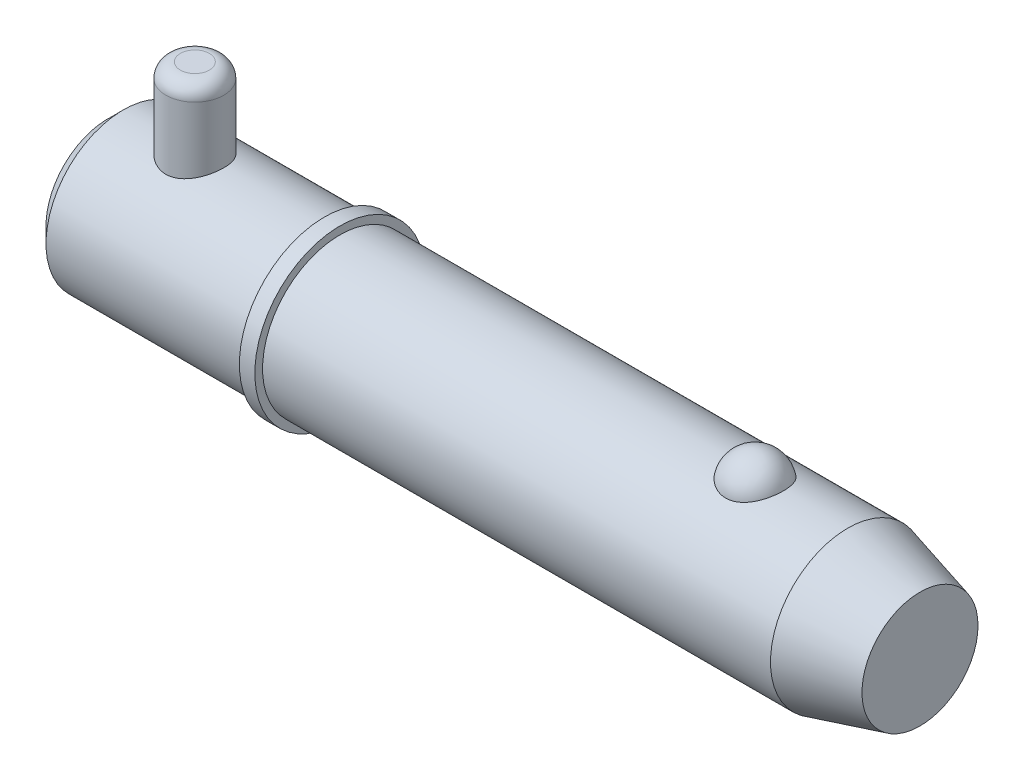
ISO-10303-21;
HEADER;
FILE_DESCRIPTION(('STEP AP214'),'2;1');
FILE_NAME('part.step','',(''),(''),'','','');
FILE_SCHEMA(('AUTOMOTIVE_DESIGN { 1 0 10303 214 1 1 1 1 }'));
ENDSEC;
DATA;
#1=APPLICATION_CONTEXT('core data for automotive mechanical design processes');
#2=APPLICATION_PROTOCOL_DEFINITION('international standard','automotive_design',2000,#1);
#3=PRODUCT_CONTEXT('',#1,'mechanical');
#4=PRODUCT('Part','Part','',(#3));
#5=PRODUCT_RELATED_PRODUCT_CATEGORY('part','',(#4));
#6=PRODUCT_DEFINITION_FORMATION('','',#4);
#7=PRODUCT_DEFINITION_CONTEXT('part definition',#1,'design');
#8=PRODUCT_DEFINITION('design','',#6,#7);
#9=PRODUCT_DEFINITION_SHAPE('','',#8);
#10=(LENGTH_UNIT() NAMED_UNIT(*) SI_UNIT(.MILLI.,.METRE.));
#11=(NAMED_UNIT(*) PLANE_ANGLE_UNIT() SI_UNIT($,.RADIAN.));
#12=(NAMED_UNIT(*) SI_UNIT($,.STERADIAN.) SOLID_ANGLE_UNIT());
#13=UNCERTAINTY_MEASURE_WITH_UNIT(LENGTH_MEASURE(1.E-05),#10,'distance_accuracy_value','');
#14=(GEOMETRIC_REPRESENTATION_CONTEXT(3) GLOBAL_UNCERTAINTY_ASSIGNED_CONTEXT((#13)) GLOBAL_UNIT_ASSIGNED_CONTEXT((#10,
#11,#12)) REPRESENTATION_CONTEXT('',''));
#15=CARTESIAN_POINT('',(0.,0.,0.));
#16=DIRECTION('',(0.,0.,1.));
#17=DIRECTION('',(1.,0.,0.));
#18=AXIS2_PLACEMENT_3D('',#15,#16,#17);
#19=CARTESIAN_POINT('',(14.28,25.4,0.));
#20=DIRECTION('',(0.,-1.,0.));
#21=DIRECTION('',(0.,0.,-1.));
#22=AXIS2_PLACEMENT_3D('',#19,#20,#21);
#23=CYLINDRICAL_SURFACE('',#22,4.76);
#24=CARTESIAN_POINT('',(14.28,-10.32,0.));
#25=DIRECTION('',(0.,1.,0.));
#26=DIRECTION('',(0.,0.,1.));
#27=AXIS2_PLACEMENT_3D('',#24,#25,#26);
#28=CIRCLE('',#27,4.76);
#29=CARTESIAN_POINT('',(14.28,-10.32,-4.76));
#30=VERTEX_POINT('',#29);
#31=EDGE_CURVE('P0_E25',#30,#30,#28,.T.);
#32=CARTESIAN_POINT('',(14.28,23.02,0.));
#33=DIRECTION('',(0.,1.,0.));
#34=DIRECTION('',(0.,0.,1.));
#35=AXIS2_PLACEMENT_3D('',#32,#33,#34);
#36=CIRCLE('',#35,4.76);
#37=CARTESIAN_POINT('',(14.28,23.02,-4.76));
#38=VERTEX_POINT('',#37);
#39=EDGE_CURVE('P0_E29',#38,#38,#36,.F.);
#40=CARTESIAN_POINT('',(14.28,-10.32,-4.76));
#41=CARTESIAN_POINT('',(14.28,-9.97270833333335,-4.76));
#42=CARTESIAN_POINT('',(14.28,-9.62541666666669,-4.76));
#43=CARTESIAN_POINT('',(14.28,-8.93083333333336,-4.76));
#44=CARTESIAN_POINT('',(14.28,-8.58354166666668,-4.76));
#45=CARTESIAN_POINT('',(14.28,-7.88895833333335,-4.76));
#46=CARTESIAN_POINT('',(14.28,-7.54166666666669,-4.76));
#47=CARTESIAN_POINT('',(14.28,-6.84708333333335,-4.76));
#48=CARTESIAN_POINT('',(14.28,-6.49979166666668,-4.76));
#49=CARTESIAN_POINT('',(14.28,-5.80520833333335,-4.76));
#50=CARTESIAN_POINT('',(14.28,-5.45791666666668,-4.76));
#51=CARTESIAN_POINT('',(14.28,-4.76333333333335,-4.76));
#52=CARTESIAN_POINT('',(14.28,-4.41604166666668,-4.76));
#53=CARTESIAN_POINT('',(14.28,-3.72145833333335,-4.76));
#54=CARTESIAN_POINT('',(14.28,-3.37416666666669,-4.76));
#55=CARTESIAN_POINT('',(14.28,-2.67958333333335,-4.76));
#56=CARTESIAN_POINT('',(14.28,-2.33229166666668,-4.76));
#57=CARTESIAN_POINT('',(14.28,-1.63770833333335,-4.76));
#58=CARTESIAN_POINT('',(14.28,-1.29041666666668,-4.76));
#59=CARTESIAN_POINT('',(14.28,-0.595833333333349,-4.76));
#60=CARTESIAN_POINT('',(14.28,-0.24854166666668,-4.76));
#61=CARTESIAN_POINT('',(14.28,0.446041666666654,-4.76));
#62=CARTESIAN_POINT('',(14.28,0.793333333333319,-4.76));
#63=CARTESIAN_POINT('',(14.28,1.48791666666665,-4.76));
#64=CARTESIAN_POINT('',(14.28,1.83520833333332,-4.76));
#65=CARTESIAN_POINT('',(14.28,2.52979166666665,-4.76));
#66=CARTESIAN_POINT('',(14.28,2.87708333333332,-4.76));
#67=CARTESIAN_POINT('',(14.28,3.57166666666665,-4.76));
#68=CARTESIAN_POINT('',(14.28,3.91895833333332,-4.76));
#69=CARTESIAN_POINT('',(14.28,4.61354166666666,-4.76));
#70=CARTESIAN_POINT('',(14.28,4.96083333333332,-4.76));
#71=CARTESIAN_POINT('',(14.28,5.65541666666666,-4.76));
#72=CARTESIAN_POINT('',(14.28,6.00270833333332,-4.76));
#73=CARTESIAN_POINT('',(14.28,6.69729166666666,-4.76));
#74=CARTESIAN_POINT('',(14.28,7.04458333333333,-4.76));
#75=CARTESIAN_POINT('',(14.28,7.73916666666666,-4.76));
#76=CARTESIAN_POINT('',(14.28,8.08645833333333,-4.76));
#77=CARTESIAN_POINT('',(14.28,8.78104166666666,-4.76));
#78=CARTESIAN_POINT('',(14.28,9.12833333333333,-4.76));
#79=CARTESIAN_POINT('',(14.28,9.82291666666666,-4.76));
#80=CARTESIAN_POINT('',(14.28,10.1702083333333,-4.76));
#81=CARTESIAN_POINT('',(14.28,10.8647916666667,-4.76));
#82=CARTESIAN_POINT('',(14.28,11.2120833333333,-4.76));
#83=CARTESIAN_POINT('',(14.28,11.9066666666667,-4.76));
#84=CARTESIAN_POINT('',(14.28,12.2539583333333,-4.76));
#85=CARTESIAN_POINT('',(14.28,12.9485416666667,-4.76));
#86=CARTESIAN_POINT('',(14.28,13.2958333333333,-4.76));
#87=CARTESIAN_POINT('',(14.28,13.9904166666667,-4.76));
#88=CARTESIAN_POINT('',(14.28,14.3377083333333,-4.76));
#89=CARTESIAN_POINT('',(14.28,15.0322916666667,-4.76));
#90=CARTESIAN_POINT('',(14.28,15.3795833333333,-4.76));
#91=CARTESIAN_POINT('',(14.28,16.0741666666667,-4.76));
#92=CARTESIAN_POINT('',(14.28,16.4214583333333,-4.76));
#93=CARTESIAN_POINT('',(14.28,17.1160416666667,-4.76));
#94=CARTESIAN_POINT('',(14.28,17.4633333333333,-4.76));
#95=CARTESIAN_POINT('',(14.28,18.1579166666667,-4.76));
#96=CARTESIAN_POINT('',(14.28,18.5052083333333,-4.76));
#97=CARTESIAN_POINT('',(14.28,19.1997916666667,-4.76));
#98=CARTESIAN_POINT('',(14.28,19.5470833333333,-4.76));
#99=CARTESIAN_POINT('',(14.28,20.2416666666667,-4.76));
#100=CARTESIAN_POINT('',(14.28,20.5889583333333,-4.76));
#101=CARTESIAN_POINT('',(14.28,21.2835416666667,-4.76));
#102=CARTESIAN_POINT('',(14.28,21.6308333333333,-4.76));
#103=CARTESIAN_POINT('',(14.28,22.3254166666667,-4.76));
#104=CARTESIAN_POINT('',(14.28,22.6727083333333,-4.76));
#105=CARTESIAN_POINT('',(14.28,23.02,-4.76));
#106=B_SPLINE_CURVE_WITH_KNOTS('',3,(#40,#41,#42,#43,#44,#45,#46,#47,#48,#49,#50,#51,#52,#53,
#54,#55,#56,#57,#58,#59,#60,#61,#62,#63,#64,#65,#66,#67,#68,#69,#70,#71,#72,#73,#74,#75,#76,#77,
#78,#79,#80,#81,#82,#83,#84,#85,#86,#87,#88,#89,#90,#91,#92,#93,#94,#95,#96,#97,#98,#99,#100,
#101,#102,#103,#104,#105),.UNSPECIFIED.,.F.,.F.,(4,2,2,2,2,2,2,2,2,2,2,2,2,2,2,2,2,2,2,2,2,2,2,
2,2,2,2,2,2,2,2,2,4),(0.,1.041875,2.08375,3.125625,4.1675,5.209375,6.25125,7.293125,
8.33500000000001,9.376875,10.41875,11.460625,12.5025,13.544375,14.58625,15.628125,16.67,
17.711875,18.75375,19.795625,20.8375,21.879375,22.92125,23.963125,25.005,26.046875,27.08875,
28.130625,29.1725,30.214375,31.25625,32.298125,33.34),.UNSPECIFIED.);
#107=EDGE_CURVE('P0_BSEAM14',#30,#38,#106,.T.);
#108=ORIENTED_EDGE('',*,*,#31,.T.);
#109=ORIENTED_EDGE('',*,*,#39,.T.);
#110=ORIENTED_EDGE('',*,*,#107,.T.);
#111=ORIENTED_EDGE('',*,*,#107,.F.);
#112=EDGE_LOOP('',(#108,#110,#109,#111));
#113=FACE_BOUND('',#112,.T.);
#114=ADVANCED_FACE('P0_F14',(#113),#23,.T.);
#115=CARTESIAN_POINT('',(14.28,25.4,0.));
#116=DIRECTION('',(0.,1.,0.));
#117=DIRECTION('',(0.,0.,1.));
#118=AXIS2_PLACEMENT_3D('',#115,#116,#117);
#119=PLANE('',#118);
#120=CARTESIAN_POINT('',(14.28,25.4,0.));
#121=DIRECTION('',(0.,1.,0.));
#122=DIRECTION('',(0.,0.,1.));
#123=AXIS2_PLACEMENT_3D('',#120,#121,#122);
#124=CIRCLE('',#123,2.38);
#125=CARTESIAN_POINT('',(14.28,25.4,2.38));
#126=VERTEX_POINT('',#125);
#127=EDGE_CURVE('P0_E10',#126,#126,#124,.T.);
#128=ORIENTED_EDGE('',*,*,#127,.T.);
#129=EDGE_LOOP('',(#128));
#130=FACE_BOUND('',#129,.T.);
#131=ADVANCED_FACE('P0_F46',(#130),#119,.T.);
#132=CARTESIAN_POINT('',(14.28,-12.7,0.));
#133=DIRECTION('',(0.,1.,0.));
#134=DIRECTION('',(0.,0.,1.));
#135=AXIS2_PLACEMENT_3D('',#132,#133,#134);
#136=PLANE('',#135);
#137=CARTESIAN_POINT('',(14.28,-12.7,0.));
#138=DIRECTION('',(0.,1.,0.));
#139=DIRECTION('',(0.,0.,1.));
#140=AXIS2_PLACEMENT_3D('',#137,#138,#139);
#141=CIRCLE('',#140,2.38);
#142=CARTESIAN_POINT('',(14.28,-12.7,2.38));
#143=VERTEX_POINT('',#142);
#144=EDGE_CURVE('P0_E21',#143,#143,#141,.F.);
#145=ORIENTED_EDGE('',*,*,#144,.T.);
#146=EDGE_LOOP('',(#145));
#147=FACE_BOUND('',#146,.T.);
#148=ADVANCED_FACE('P0_F43',(#147),#136,.F.);
#149=CARTESIAN_POINT('',(14.28,-10.32,0.));
#150=DIRECTION('',(0.,1.,0.));
#151=DIRECTION('',(0.,0.,1.));
#152=AXIS2_PLACEMENT_3D('',#149,#150,#151);
#153=DEGENERATE_TOROIDAL_SURFACE('',#152,2.38,2.38,.T.);
#154=ORIENTED_EDGE('',*,*,#144,.F.);
#155=EDGE_LOOP('',(#154));
#156=FACE_BOUND('',#155,.T.);
#157=ORIENTED_EDGE('',*,*,#31,.F.);
#158=EDGE_LOOP('',(#157));
#159=FACE_BOUND('',#158,.T.);
#160=ADVANCED_FACE('P0_F38',(#156,#159),#153,.T.);
#161=CARTESIAN_POINT('',(14.28,23.02,0.));
#162=DIRECTION('',(0.,1.,0.));
#163=DIRECTION('',(0.,0.,1.));
#164=AXIS2_PLACEMENT_3D('',#161,#162,#163);
#165=DEGENERATE_TOROIDAL_SURFACE('',#164,2.38,2.38,.T.);
#166=ORIENTED_EDGE('',*,*,#39,.F.);
#167=EDGE_LOOP('',(#166));
#168=FACE_BOUND('',#167,.T.);
#169=ORIENTED_EDGE('',*,*,#127,.F.);
#170=EDGE_LOOP('',(#169));
#171=FACE_BOUND('',#170,.T.);
#172=ADVANCED_FACE('P0_F16',(#168,#171),#165,.T.);
#173=CLOSED_SHELL('',(#114,#131,#148,#160,#172));
#174=MANIFOLD_SOLID_BREP('P0_B1',#173);
#175=CARTESIAN_POINT('',(0.,0.,0.));
#176=DIRECTION('',(1.,0.,0.));
#177=DIRECTION('',(0.,0.,-1.));
#178=AXIS2_PLACEMENT_3D('',#175,#176,#177);
#179=CYLINDRICAL_SURFACE('',#178,12.7);
#180=CARTESIAN_POINT('',(121.500738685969,0.,0.));
#181=DIRECTION('',(1.,0.,0.));
#182=DIRECTION('',(0.,0.,-1.));
#183=AXIS2_PLACEMENT_3D('',#180,#181,#182);
#184=CIRCLE('',#183,12.7);
#185=CARTESIAN_POINT('',(121.500738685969,0.,-12.7));
#186=VERTEX_POINT('',#185);
#187=EDGE_CURVE('P1_E81',#186,#186,#184,.T.);
#188=ORIENTED_EDGE('',*,*,#187,.F.);
#189=EDGE_LOOP('',(#188));
#190=FACE_BOUND('',#189,.T.);
#191=CARTESIAN_POINT('',(38.1,0.,0.));
#192=DIRECTION('',(1.,0.,0.));
#193=DIRECTION('',(0.,0.,-1.));
#194=AXIS2_PLACEMENT_3D('',#191,#192,#193);
#195=CIRCLE('',#194,12.7);
#196=CARTESIAN_POINT('',(38.1,0.,-12.7));
#197=VERTEX_POINT('',#196);
#198=EDGE_CURVE('P1_E85',#197,#197,#195,.T.);
#199=ORIENTED_EDGE('',*,*,#198,.T.);
#200=EDGE_LOOP('',(#199));
#201=FACE_BOUND('',#200,.T.);
#202=CARTESIAN_POINT('',(106.260042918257,11.7500437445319,4.81938502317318));
#203=CARTESIAN_POINT('',(106.135088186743,11.7500430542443,4.81938571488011));
#204=CARTESIAN_POINT('',(106.010144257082,11.7520975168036,4.81438658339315));
#205=CARTESIAN_POINT('',(105.761142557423,11.760253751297,4.79442904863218));
#206=CARTESIAN_POINT('',(105.637085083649,11.7663568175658,4.77946746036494));
#207=CARTESIAN_POINT('',(105.390901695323,11.7824262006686,4.7397141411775));
#208=CARTESIAN_POINT('',(105.268774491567,11.7923898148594,4.71492928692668));
#209=CARTESIAN_POINT('',(105.027187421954,11.8158938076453,4.65571340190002));
#210=CARTESIAN_POINT('',(104.90772859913,11.8294355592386,4.6212786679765));
#211=CARTESIAN_POINT('',(104.672557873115,11.8596812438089,4.54309502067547));
#212=CARTESIAN_POINT('',(104.556839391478,11.8763792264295,4.49936361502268));
#213=CARTESIAN_POINT('',(104.329653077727,11.9124878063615,4.40287235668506));
#214=CARTESIAN_POINT('',(104.218186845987,11.9318994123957,4.35010914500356));
#215=CARTESIAN_POINT('',(103.891278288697,11.9934256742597,4.17881316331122));
#216=CARTESIAN_POINT('',(103.683127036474,12.038858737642,4.04720756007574));
#217=CARTESIAN_POINT('',(103.285850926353,12.1352173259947,3.748564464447));
#218=CARTESIAN_POINT('',(103.097443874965,12.1862630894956,3.58061821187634));
#219=CARTESIAN_POINT('',(102.750521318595,12.2875163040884,3.21600758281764));
#220=CARTESIAN_POINT('',(102.592011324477,12.3377235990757,3.0193379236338));
#221=CARTESIAN_POINT('',(102.30168878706,12.434492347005,2.592916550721));
#222=CARTESIAN_POINT('',(102.171376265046,12.4807925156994,2.36208286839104));
#223=CARTESIAN_POINT('',(101.949407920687,12.5623454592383,1.88070399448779));
#224=CARTESIAN_POINT('',(101.857755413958,12.5975972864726,1.63015711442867));
#225=CARTESIAN_POINT('',(101.714046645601,12.6538414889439,1.1129886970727));
#226=CARTESIAN_POINT('',(101.662499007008,12.6746503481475,0.846205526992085));
#227=CARTESIAN_POINT('',(101.601977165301,12.699153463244,0.307085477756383));
#228=CARTESIAN_POINT('',(101.593001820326,12.7028481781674,0.0347487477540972));
#229=CARTESIAN_POINT('',(101.617731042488,12.6927785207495,-0.506073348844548));
#230=CARTESIAN_POINT('',(101.651189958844,12.6791146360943,-0.77457186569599));
#231=CARTESIAN_POINT('',(101.759687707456,12.635882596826,-1.30170246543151));
#232=CARTESIAN_POINT('',(101.83472729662,12.606314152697,-1.5603343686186));
#233=CARTESIAN_POINT('',(102.02500006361,12.5342328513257,-2.06083899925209));
#234=CARTESIAN_POINT('',(102.140287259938,12.4917026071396,-2.3026886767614));
#235=CARTESIAN_POINT('',(102.408704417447,12.3981123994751,-2.76259600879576));
#236=CARTESIAN_POINT('',(102.561837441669,12.3470517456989,-2.98065173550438));
#237=CARTESIAN_POINT('',(102.903507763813,12.2416045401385,-3.38786328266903));
#238=CARTESIAN_POINT('',(103.092201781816,12.1872040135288,-3.57688418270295));
#239=CARTESIAN_POINT('',(103.500239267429,12.0814086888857,-3.91941073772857));
#240=CARTESIAN_POINT('',(103.719580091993,12.0300136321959,-4.07291945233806));
#241=CARTESIAN_POINT('',(104.178375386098,11.9373542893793,-4.33691289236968));
#242=CARTESIAN_POINT('',(104.417304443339,11.8958982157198,-4.44824125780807));
#243=CARTESIAN_POINT('',(104.91243761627,11.8268116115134,-4.62881985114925));
#244=CARTESIAN_POINT('',(105.168635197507,11.7991758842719,-4.69808589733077));
#245=CARTESIAN_POINT('',(105.677164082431,11.7622209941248,-4.78983181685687));
#246=CARTESIAN_POINT('',(105.929041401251,11.7520502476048,-4.81449025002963));
#247=CARTESIAN_POINT('',(106.433573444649,11.7485796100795,-4.82295735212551));
#248=CARTESIAN_POINT('',(106.686228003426,11.7552763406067,-4.80677420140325));
#249=CARTESIAN_POINT('',(107.176834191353,11.7842584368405,-4.73525430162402));
#250=CARTESIAN_POINT('',(107.414998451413,11.8060486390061,-4.68116061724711));
#251=CARTESIAN_POINT('',(107.878489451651,11.8622750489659,-4.53678133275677));
#252=CARTESIAN_POINT('',(108.103815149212,11.8967122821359,-4.44649279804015));
#253=CARTESIAN_POINT('',(108.540801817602,11.9754603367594,-4.2298761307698));
#254=CARTESIAN_POINT('',(108.752057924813,12.0199699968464,-4.10280539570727));
#255=CARTESIAN_POINT('',(109.150601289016,12.1138028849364,-3.81685409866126));
#256=CARTESIAN_POINT('',(109.337883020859,12.163127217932,-3.65796622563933));
#257=CARTESIAN_POINT('',(109.693350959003,12.2642343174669,-3.30364864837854));
#258=CARTESIAN_POINT('',(109.860111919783,12.3160165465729,-3.10678783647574));
#259=CARTESIAN_POINT('',(110.159579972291,12.4142566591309,-2.68748409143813));
#260=CARTESIAN_POINT('',(110.292280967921,12.4607135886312,-2.46503658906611));
#261=CARTESIAN_POINT('',(110.524691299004,12.5450236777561,-1.99289519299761));
#262=CARTESIAN_POINT('',(110.623215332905,12.5825557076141,-1.74255918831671));
#263=CARTESIAN_POINT('',(110.779227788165,12.6431720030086,-1.22773734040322));
#264=CARTESIAN_POINT('',(110.836715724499,12.6662560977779,-0.963251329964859));
#265=CARTESIAN_POINT('',(110.909544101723,12.6956486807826,-0.427355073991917));
#266=CARTESIAN_POINT('',(110.924837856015,12.7019385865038,-0.1559374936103));
#267=CARTESIAN_POINT('',(110.912779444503,12.6970201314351,0.385928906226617));
#268=CARTESIAN_POINT('',(110.88542805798,12.6858120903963,0.656377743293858));
#269=CARTESIAN_POINT('',(110.813060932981,12.6568455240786,1.05454017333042));
#270=CARTESIAN_POINT('',(110.783796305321,12.6451962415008,1.18577850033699));
#271=CARTESIAN_POINT('',(110.715022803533,12.6181819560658,1.4451380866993));
#272=CARTESIAN_POINT('',(110.675517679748,12.6028183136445,1.57326046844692));
#273=CARTESIAN_POINT('',(110.586439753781,12.5687547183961,1.82554978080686));
#274=CARTESIAN_POINT('',(110.536862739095,12.5500533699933,1.9497150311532));
#275=CARTESIAN_POINT('',(110.42792115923,12.5098093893,2.1931437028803));
#276=CARTESIAN_POINT('',(110.368560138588,12.4882677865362,2.31240887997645));
#277=CARTESIAN_POINT('',(110.23997128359,12.4427679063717,2.54593031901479));
#278=CARTESIAN_POINT('',(110.170688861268,12.4187964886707,2.66015396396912));
#279=CARTESIAN_POINT('',(110.022903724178,12.3691892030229,2.88202659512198));
#280=CARTESIAN_POINT('',(109.944404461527,12.3435539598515,2.98967802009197));
#281=CARTESIAN_POINT('',(109.778550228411,12.2912955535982,3.19774385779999));
#282=CARTESIAN_POINT('',(109.691191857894,12.2646720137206,3.29815546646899));
#283=CARTESIAN_POINT('',(109.508161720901,12.2111945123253,3.49095035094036));
#284=CARTESIAN_POINT('',(109.412493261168,12.1843406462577,3.58333679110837));
#285=CARTESIAN_POINT('',(109.213627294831,12.1312249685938,3.75922876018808));
#286=CARTESIAN_POINT('',(109.110450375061,12.104961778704,3.84275713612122));
#287=CARTESIAN_POINT('',(108.89701336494,12.0537284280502,4.00056406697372));
#288=CARTESIAN_POINT('',(108.786756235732,12.028757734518,4.07484645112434));
#289=CARTESIAN_POINT('',(108.559755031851,11.9808306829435,4.21367959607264));
#290=CARTESIAN_POINT('',(108.443006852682,11.9578756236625,4.27822410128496));
#291=CARTESIAN_POINT('',(108.20394258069,11.9147184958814,4.39698483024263));
#292=CARTESIAN_POINT('',(108.081628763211,11.894515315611,4.45120522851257));
#293=CARTESIAN_POINT('',(107.822952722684,11.8561129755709,4.55255353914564));
#294=CARTESIAN_POINT('',(107.686223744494,11.8381764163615,4.59884858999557));
#295=CARTESIAN_POINT('',(107.408608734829,11.8069093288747,4.67853897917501));
#296=CARTESIAN_POINT('',(107.267724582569,11.7935767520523,4.71194005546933));
#297=CARTESIAN_POINT('',(106.98309446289,11.7720277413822,4.76552188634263));
#298=CARTESIAN_POINT('',(106.839348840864,11.7638106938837,4.78570422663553));
#299=CARTESIAN_POINT('',(106.550411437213,11.7528195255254,4.81263433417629));
#300=CARTESIAN_POINT('',(106.405219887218,11.7500445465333,4.81938421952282));
#301=CARTESIAN_POINT('',(106.260042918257,11.7500437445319,4.81938502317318));
#302=B_SPLINE_CURVE_WITH_KNOTS('',3,(#202,#203,#204,#205,#206,#207,#208,#209,#210,#211,#212,
#213,#214,#215,#216,#217,#218,#219,#220,#221,#222,#223,#224,#225,#226,#227,#228,#229,#230,#231,
#232,#233,#234,#235,#236,#237,#238,#239,#240,#241,#242,#243,#244,#245,#246,#247,#248,#249,#250,
#251,#252,#253,#254,#255,#256,#257,#258,#259,#260,#261,#262,#263,#264,#265,#266,#267,#268,#269,
#270,#271,#272,#273,#274,#275,#276,#277,#278,#279,#280,#281,#282,#283,#284,#285,#286,#287,#288,
#289,#290,#291,#292,#293,#294,#295,#296,#297,#298,#299,#300,#301),.UNSPECIFIED.,.T.,.F.,(4,2,2,
2,2,2,2,2,2,2,2,2,2,2,2,2,2,2,2,2,2,2,2,2,2,2,2,2,2,2,2,2,2,2,2,2,2,2,2,2,2,2,2,2,2,2,2,2,2,4),
(0.,0.374729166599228,0.749578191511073,1.12416526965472,1.49889629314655,1.87292776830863,
2.24709865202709,2.99481328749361,3.76399449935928,4.53331735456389,5.3368391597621,
6.14042986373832,6.95405296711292,7.76765424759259,8.57656703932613,9.38549455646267,
10.1955119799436,11.0055949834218,11.8193353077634,12.6330054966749,13.4294141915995,
14.2255231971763,14.9815786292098,15.7374826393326,16.4696948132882,17.2019663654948,
17.9501979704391,18.6986017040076,19.484470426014,20.2704797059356,21.0815215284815,
21.8925729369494,22.7045213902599,23.5164550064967,23.9209608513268,24.3253187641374,
24.7298461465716,25.1342272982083,25.54092555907,25.9474719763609,26.3541750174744,
26.7607169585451,27.1661834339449,27.5714814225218,27.9770386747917,28.3824315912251,
28.818120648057,29.2536155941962,29.6890582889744,30.1244323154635),.UNSPECIFIED.);
#303=CARTESIAN_POINT('',(106.260042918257,11.7500437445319,4.81938502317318));
#304=VERTEX_POINT('',#303);
#305=EDGE_CURVE('P1_E35',#304,#304,#302,.T.);
#306=ORIENTED_EDGE('',*,*,#305,.T.);
#307=EDGE_LOOP('',(#306));
#308=FACE_BOUND('',#307,.T.);
#309=ADVANCED_FACE('P1_F13',(#190,#201,#308),#179,.T.);
#310=CARTESIAN_POINT('',(0.,0.,0.));
#311=DIRECTION('',(-1.,0.,0.));
#312=DIRECTION('',(0.,0.,1.));
#313=AXIS2_PLACEMENT_3D('',#310,#311,#312);
#314=PLANE('',#313);
#315=CARTESIAN_POINT('',(0.,0.,0.));
#316=DIRECTION('',(1.,0.,0.));
#317=DIRECTION('',(0.,0.,-1.));
#318=AXIS2_PLACEMENT_3D('',#315,#316,#317);
#319=CIRCLE('',#318,10.16);
#320=CARTESIAN_POINT('',(0.,0.,-10.16));
#321=VERTEX_POINT('',#320);
#322=EDGE_CURVE('P1_E9',#321,#321,#319,.T.);
#323=ORIENTED_EDGE('',*,*,#322,.F.);
#324=EDGE_LOOP('',(#323));
#325=FACE_BOUND('',#324,.T.);
#326=ADVANCED_FACE('P1_F15',(#325),#314,.T.);
#327=CARTESIAN_POINT('',(2.53999999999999,0.,0.));
#328=DIRECTION('',(1.,0.,0.));
#329=DIRECTION('',(0.,0.,-1.));
#330=AXIS2_PLACEMENT_3D('',#327,#328,#329);
#331=CONICAL_SURFACE('',#330,12.7,0.78539816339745);
#332=ORIENTED_EDGE('',*,*,#322,.T.);
#333=EDGE_LOOP('',(#332));
#334=FACE_BOUND('',#333,.T.);
#335=CARTESIAN_POINT('',(2.53999999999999,0.,0.));
#336=DIRECTION('',(1.,0.,0.));
#337=DIRECTION('',(0.,0.,-1.));
#338=AXIS2_PLACEMENT_3D('',#335,#336,#337);
#339=CIRCLE('',#338,12.7);
#340=CARTESIAN_POINT('',(2.53999999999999,0.,-12.7));
#341=VERTEX_POINT('',#340);
#342=EDGE_CURVE('P1_E26',#341,#341,#339,.T.);
#343=ORIENTED_EDGE('',*,*,#342,.F.);
#344=EDGE_LOOP('',(#343));
#345=FACE_BOUND('',#344,.T.);
#346=ADVANCED_FACE('P1_F77',(#334,#345),#331,.T.);
#347=CARTESIAN_POINT('',(0.,0.,0.));
#348=DIRECTION('',(1.,0.,0.));
#349=DIRECTION('',(0.,0.,-1.));
#350=AXIS2_PLACEMENT_3D('',#347,#348,#349);
#351=CYLINDRICAL_SURFACE('',#350,12.7);
#352=CARTESIAN_POINT('',(14.28,-11.7742260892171,4.76));
#353=CARTESIAN_POINT('',(14.1514948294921,-11.7742255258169,4.76000061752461));
#354=CARTESIAN_POINT('',(14.0229980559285,-11.7763355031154,4.75479194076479));
#355=CARTESIAN_POINT('',(13.7669369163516,-11.7847043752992,4.73401198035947));
#356=CARTESIAN_POINT('',(13.6393728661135,-11.7909646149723,4.71843733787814));
#357=CARTESIAN_POINT('',(13.386226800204,-11.8074248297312,4.67709434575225));
#358=CARTESIAN_POINT('',(13.2606439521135,-11.8176231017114,4.65133040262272));
#359=CARTESIAN_POINT('',(13.0122434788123,-11.8416347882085,4.58985545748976));
#360=CARTESIAN_POINT('',(12.8894269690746,-11.8554496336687,4.55414051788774));
#361=CARTESIAN_POINT('',(12.6477622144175,-11.8862222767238,4.47320764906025));
#362=CARTESIAN_POINT('',(12.5289037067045,-11.9031710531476,4.4280169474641));
#363=CARTESIAN_POINT('',(12.2955059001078,-11.939736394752,4.32845291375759));
#364=CARTESIAN_POINT('',(12.1809682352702,-11.9593539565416,4.2740761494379));
#365=CARTESIAN_POINT('',(11.8448901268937,-12.0213893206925,4.09777237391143));
#366=CARTESIAN_POINT('',(11.6307077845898,-12.0670135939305,3.9626122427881));
#367=CARTESIAN_POINT('',(11.2179129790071,-12.1641514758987,3.65386230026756));
#368=CARTESIAN_POINT('',(11.0204399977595,-12.2158379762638,3.47881300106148));
#369=CARTESIAN_POINT('',(10.6568212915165,-12.3178468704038,3.09829182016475));
#370=CARTESIAN_POINT('',(10.4906822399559,-12.3681689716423,2.89281347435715));
#371=CARTESIAN_POINT('',(10.1890299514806,-12.4638367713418,2.44867909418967));
#372=CARTESIAN_POINT('',(10.054749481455,-12.5089552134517,2.20913281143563));
#373=CARTESIAN_POINT('',(9.82886079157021,-12.5870472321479,1.70885919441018));
#374=CARTESIAN_POINT('',(9.73723778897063,-12.620025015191,1.44813923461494));
#375=CARTESIAN_POINT('',(9.60324488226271,-12.6688874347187,0.9248423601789));
#376=CARTESIAN_POINT('',(9.55892269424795,-12.6854474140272,0.662829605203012));
#377=CARTESIAN_POINT('',(9.5145335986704,-12.7020320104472,0.134596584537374));
#378=CARTESIAN_POINT('',(9.5144523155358,-12.7020619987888,-0.131622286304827));
#379=CARTESIAN_POINT('',(9.55741019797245,-12.6860129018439,-0.646717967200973));
#380=CARTESIAN_POINT('',(9.59831845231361,-12.6707298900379,-0.895801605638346));
#381=CARTESIAN_POINT('',(9.71850987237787,-12.6268158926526,-1.38327219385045));
#382=CARTESIAN_POINT('',(9.79779575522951,-12.5981839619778,-1.62165838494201));
#383=CARTESIAN_POINT('',(9.99348296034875,-12.5298894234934,-2.08508424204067));
#384=CARTESIAN_POINT('',(10.110407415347,-12.4900724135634,-2.30987931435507));
#385=CARTESIAN_POINT('',(10.3775896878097,-12.4034373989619,-2.7372158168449));
#386=CARTESIAN_POINT('',(10.5278582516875,-12.3566171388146,-2.93975004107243));
#387=CARTESIAN_POINT('',(10.8677318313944,-12.257571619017,-3.32936830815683));
#388=CARTESIAN_POINT('',(11.0591227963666,-12.2051903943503,-3.51485714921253));
#389=CARTESIAN_POINT('',(11.4706087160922,-12.1031155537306,-3.85170663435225));
#390=CARTESIAN_POINT('',(11.6907108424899,-12.0534226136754,-4.00305872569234));
#391=CARTESIAN_POINT('',(12.1596597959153,-11.9613684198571,-4.27038218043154));
#392=CARTESIAN_POINT('',(12.4090353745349,-11.9191939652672,-4.38549550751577));
#393=CARTESIAN_POINT('',(12.9256290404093,-11.8491124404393,-4.57149117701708));
#394=CARTESIAN_POINT('',(13.1928371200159,-11.8211974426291,-4.64239810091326));
#395=CARTESIAN_POINT('',(13.7217488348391,-11.7846654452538,-4.73434137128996));
#396=CARTESIAN_POINT('',(13.9829438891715,-11.7750694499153,-4.75791141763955));
#397=CARTESIAN_POINT('',(14.5056760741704,-11.7734909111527,-4.76182097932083));
#398=CARTESIAN_POINT('',(14.7672131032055,-11.7815039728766,-4.74217128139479));
#399=CARTESIAN_POINT('',(15.2702140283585,-11.8132466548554,-4.66249544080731));
#400=CARTESIAN_POINT('',(15.5120417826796,-11.8362133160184,-4.60442726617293));
#401=CARTESIAN_POINT('',(15.9824097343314,-11.8943704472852,-4.45202868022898));
#402=CARTESIAN_POINT('',(16.2109472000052,-11.9295634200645,-4.35769084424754));
#403=CARTESIAN_POINT('',(16.6577741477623,-12.0098310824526,-4.13144368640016));
#404=CARTESIAN_POINT('',(16.8753590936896,-12.055226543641,-3.99825937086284));
#405=CARTESIAN_POINT('',(17.2859732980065,-12.150238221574,-3.69949845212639));
#406=CARTESIAN_POINT('',(17.4789935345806,-12.19985597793,-3.5339100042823));
#407=CARTESIAN_POINT('',(17.8477707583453,-12.3015434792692,-3.1624728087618));
#408=CARTESIAN_POINT('',(18.0216609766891,-12.3535695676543,-2.95473880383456));
#409=CARTESIAN_POINT('',(18.254545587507,-12.426745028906,-2.62277433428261));
#410=CARTESIAN_POINT('',(18.3275489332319,-12.4503382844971,-2.50865480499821));
#411=CARTESIAN_POINT('',(18.463723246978,-12.4952713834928,-2.27428971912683));
#412=CARTESIAN_POINT('',(18.5268984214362,-12.5166121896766,-2.15404681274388));
#413=CARTESIAN_POINT('',(18.6427140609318,-12.5563817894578,-1.90858448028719));
#414=CARTESIAN_POINT('',(18.6953855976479,-12.5748191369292,-1.78338108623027));
#415=CARTESIAN_POINT('',(18.7899337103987,-12.6083284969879,-1.52857834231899));
#416=CARTESIAN_POINT('',(18.8318147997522,-12.6234019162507,-1.39898085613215));
#417=CARTESIAN_POINT('',(18.9043819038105,-12.6497495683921,-1.13633254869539));
#418=CARTESIAN_POINT('',(18.9350698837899,-12.6610244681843,-1.00328233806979));
#419=CARTESIAN_POINT('',(18.9849303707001,-12.6794412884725,-0.734761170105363));
#420=CARTESIAN_POINT('',(19.0041035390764,-12.6865834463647,-0.59929035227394));
#421=CARTESIAN_POINT('',(19.0299427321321,-12.6962286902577,-0.335006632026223));
#422=CARTESIAN_POINT('',(19.0372742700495,-12.698978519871,-0.206267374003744));
#423=CARTESIAN_POINT('',(19.0414668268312,-12.7005496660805,0.0514515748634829));
#424=CARTESIAN_POINT('',(19.038324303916,-12.69936965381,0.180431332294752));
#425=CARTESIAN_POINT('',(19.0215965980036,-12.6931114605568,0.437551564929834));
#426=CARTESIAN_POINT('',(19.0080165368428,-12.6880351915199,0.565692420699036));
#427=CARTESIAN_POINT('',(18.9705519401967,-12.6741222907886,0.820297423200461));
#428=CARTESIAN_POINT('',(18.9466635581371,-12.665284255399,0.946760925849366));
#429=CARTESIAN_POINT('',(18.8895279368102,-12.6443449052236,1.19395899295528));
#430=CARTESIAN_POINT('',(18.8565273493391,-12.6323299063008,1.3147578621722));
#431=CARTESIAN_POINT('',(18.781239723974,-12.6052503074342,1.55308888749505));
#432=CARTESIAN_POINT('',(18.738949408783,-12.5901846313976,1.67061987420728));
#433=CARTESIAN_POINT('',(18.5986461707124,-12.5409473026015,2.01714406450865));
#434=CARTESIAN_POINT('',(18.4871532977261,-12.502717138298,2.24027279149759));
#435=CARTESIAN_POINT('',(18.2262440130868,-12.4173042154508,2.6742599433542));
#436=CARTESIAN_POINT('',(18.0754310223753,-12.3698127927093,2.88420891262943));
#437=CARTESIAN_POINT('',(17.7421836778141,-12.271667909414,3.27675114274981));
#438=CARTESIAN_POINT('',(17.5597380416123,-12.2210133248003,3.45933459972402));
#439=CARTESIAN_POINT('',(17.2605468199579,-12.1452079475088,3.7138066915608));
#440=CARTESIAN_POINT('',(17.1535518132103,-12.119328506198,3.79719993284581));
#441=CARTESIAN_POINT('',(16.9326449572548,-12.0688597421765,3.95467398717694));
#442=CARTESIAN_POINT('',(16.8187356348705,-12.0442699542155,4.02875817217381));
#443=CARTESIAN_POINT('',(16.5846234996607,-11.9971053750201,4.16711104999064));
#444=CARTESIAN_POINT('',(16.4644172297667,-11.9745317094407,4.23137427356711));
#445=CARTESIAN_POINT('',(16.2185866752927,-11.9321360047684,4.34949041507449));
#446=CARTESIAN_POINT('',(16.09296473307,-11.9123127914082,4.40334777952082));
#447=CARTESIAN_POINT('',(15.8314769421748,-11.875268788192,4.50232278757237));
#448=CARTESIAN_POINT('',(15.6954035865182,-11.8582009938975,4.54695127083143));
#449=CARTESIAN_POINT('',(15.4194002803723,-11.8284328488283,4.62383807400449));
#450=CARTESIAN_POINT('',(15.2794720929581,-11.815730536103,4.6561019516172));
#451=CARTESIAN_POINT('',(14.9969657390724,-11.7951940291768,4.70788444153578));
#452=CARTESIAN_POINT('',(14.8543884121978,-11.7873583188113,4.72740702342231));
#453=CARTESIAN_POINT('',(14.5678704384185,-11.7768749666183,4.75346370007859));
#454=CARTESIAN_POINT('',(14.4239299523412,-11.7742267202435,4.75999930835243));
#455=CARTESIAN_POINT('',(14.28,-11.7742260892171,4.76));
#456=B_SPLINE_CURVE_WITH_KNOTS('',3,(#352,#353,#354,#355,#356,#357,#358,#359,#360,#361,#362,
#363,#364,#365,#366,#367,#368,#369,#370,#371,#372,#373,#374,#375,#376,#377,#378,#379,#380,#381,
#382,#383,#384,#385,#386,#387,#388,#389,#390,#391,#392,#393,#394,#395,#396,#397,#398,#399,#400,
#401,#402,#403,#404,#405,#406,#407,#408,#409,#410,#411,#412,#413,#414,#415,#416,#417,#418,#419,
#420,#421,#422,#423,#424,#425,#426,#427,#428,#429,#430,#431,#432,#433,#434,#435,#436,#437,#438,
#439,#440,#441,#442,#443,#444,#445,#446,#447,#448,#449,#450,#451,#452,#453,#454,#455),
.UNSPECIFIED.,.T.,.F.,(4,2,2,2,2,2,2,2,2,2,2,2,2,2,2,2,2,2,2,2,2,2,2,2,2,2,2,2,2,2,2,2,2,2,2,2,
2,2,2,2,2,2,2,2,2,2,2,2,2,2,2,4),(0.,0.385378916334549,0.770882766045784,1.15622008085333,
1.54171009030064,1.92610725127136,2.31064835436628,3.07917291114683,3.88239385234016,
4.68578566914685,5.51648193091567,6.34689010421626,7.14151420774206,7.93588010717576,
8.69098665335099,9.44614666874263,10.2122918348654,10.9786842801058,11.789876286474,
12.6012713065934,13.4306405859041,14.2595482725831,15.0427613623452,15.8257790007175,
16.5716820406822,17.3177378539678,18.0917395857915,18.8660247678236,19.6893332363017,
20.1014571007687,20.5134040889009,20.9241137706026,21.3346513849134,21.7451168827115,
22.1555587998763,22.542011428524,22.928594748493,23.3149884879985,23.7015265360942,
24.0784835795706,24.4555738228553,25.2091300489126,25.994347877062,26.7798463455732,
27.1937428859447,27.6074890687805,28.0214648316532,28.4352633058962,28.8672794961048,
29.299101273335,29.7307884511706,30.1624253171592),.UNSPECIFIED.);
#457=CARTESIAN_POINT('',(14.28,-11.7742260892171,4.76));
#458=VERTEX_POINT('',#457);
#459=EDGE_CURVE('P1_E17',#458,#458,#456,.T.);
#460=ORIENTED_EDGE('',*,*,#459,.F.);
#461=EDGE_LOOP('',(#460));
#462=FACE_BOUND('',#461,.T.);
#463=CARTESIAN_POINT('',(14.28,11.7742260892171,4.76));
#464=CARTESIAN_POINT('',(14.4085051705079,11.7742255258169,4.76000061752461));
#465=CARTESIAN_POINT('',(14.5370019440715,11.7763355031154,4.75479194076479));
#466=CARTESIAN_POINT('',(14.7930630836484,11.7847043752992,4.73401198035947));
#467=CARTESIAN_POINT('',(14.9206271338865,11.7909646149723,4.71843733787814));
#468=CARTESIAN_POINT('',(15.173773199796,11.8074248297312,4.67709434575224));
#469=CARTESIAN_POINT('',(15.2993560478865,11.8176231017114,4.65133040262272));
#470=CARTESIAN_POINT('',(15.5477565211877,11.8416347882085,4.58985545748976));
#471=CARTESIAN_POINT('',(15.6705730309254,11.8554496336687,4.55414051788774));
#472=CARTESIAN_POINT('',(15.9122377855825,11.8862222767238,4.47320764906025));
#473=CARTESIAN_POINT('',(16.0310962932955,11.9031710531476,4.4280169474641));
#474=CARTESIAN_POINT('',(16.2644940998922,11.939736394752,4.32845291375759));
#475=CARTESIAN_POINT('',(16.3790317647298,11.9593539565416,4.2740761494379));
#476=CARTESIAN_POINT('',(16.7151098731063,12.0213893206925,4.09777237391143));
#477=CARTESIAN_POINT('',(16.9292922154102,12.0670135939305,3.96261224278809));
#478=CARTESIAN_POINT('',(17.3420870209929,12.1641514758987,3.65386230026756));
#479=CARTESIAN_POINT('',(17.5395600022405,12.2158379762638,3.47881300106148));
#480=CARTESIAN_POINT('',(17.9031787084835,12.3178468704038,3.09829182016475));
#481=CARTESIAN_POINT('',(18.0693177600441,12.3681689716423,2.89281347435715));
#482=CARTESIAN_POINT('',(18.3709700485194,12.4638367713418,2.44867909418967));
#483=CARTESIAN_POINT('',(18.505250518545,12.5089552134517,2.20913281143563));
#484=CARTESIAN_POINT('',(18.7311392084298,12.5870472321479,1.70885919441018));
#485=CARTESIAN_POINT('',(18.8227622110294,12.620025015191,1.44813923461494));
#486=CARTESIAN_POINT('',(18.9567551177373,12.6688874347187,0.924842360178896));
#487=CARTESIAN_POINT('',(19.0010773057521,12.6854474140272,0.662829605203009));
#488=CARTESIAN_POINT('',(19.0454664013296,12.7020320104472,0.134596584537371));
#489=CARTESIAN_POINT('',(19.0455476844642,12.7020619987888,-0.13162228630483));
#490=CARTESIAN_POINT('',(19.0025898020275,12.6860129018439,-0.646717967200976));
#491=CARTESIAN_POINT('',(18.9616815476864,12.6707298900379,-0.89580160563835));
#492=CARTESIAN_POINT('',(18.8414901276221,12.6268158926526,-1.38327219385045));
#493=CARTESIAN_POINT('',(18.7622042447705,12.5981839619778,-1.62165838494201));
#494=CARTESIAN_POINT('',(18.5665170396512,12.5298894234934,-2.08508424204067));
#495=CARTESIAN_POINT('',(18.449592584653,12.4900724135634,-2.30987931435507));
#496=CARTESIAN_POINT('',(18.1824103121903,12.4034373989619,-2.7372158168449));
#497=CARTESIAN_POINT('',(18.0321417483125,12.3566171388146,-2.93975004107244));
#498=CARTESIAN_POINT('',(17.6922681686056,12.257571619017,-3.32936830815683));
#499=CARTESIAN_POINT('',(17.5008772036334,12.2051903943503,-3.51485714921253));
#500=CARTESIAN_POINT('',(17.0893912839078,12.1031155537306,-3.85170663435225));
#501=CARTESIAN_POINT('',(16.8692891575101,12.0534226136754,-4.00305872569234));
#502=CARTESIAN_POINT('',(16.4003402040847,11.9613684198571,-4.27038218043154));
#503=CARTESIAN_POINT('',(16.1509646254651,11.9191939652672,-4.38549550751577));
#504=CARTESIAN_POINT('',(15.6343709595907,11.8491124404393,-4.57149117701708));
#505=CARTESIAN_POINT('',(15.367162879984,11.8211974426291,-4.64239810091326));
#506=CARTESIAN_POINT('',(14.8382511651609,11.7846654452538,-4.73434137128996));
#507=CARTESIAN_POINT('',(14.5770561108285,11.7750694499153,-4.75791141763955));
#508=CARTESIAN_POINT('',(14.0543239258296,11.7734909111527,-4.76182097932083));
#509=CARTESIAN_POINT('',(13.7927868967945,11.7815039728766,-4.74217128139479));
#510=CARTESIAN_POINT('',(13.2897859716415,11.8132466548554,-4.66249544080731));
#511=CARTESIAN_POINT('',(13.0479582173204,11.8362133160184,-4.60442726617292));
#512=CARTESIAN_POINT('',(12.5775902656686,11.8943704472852,-4.45202868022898));
#513=CARTESIAN_POINT('',(12.3490527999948,11.9295634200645,-4.35769084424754));
#514=CARTESIAN_POINT('',(11.9022258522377,12.0098310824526,-4.13144368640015));
#515=CARTESIAN_POINT('',(11.6846409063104,12.055226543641,-3.99825937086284));
#516=CARTESIAN_POINT('',(11.2740267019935,12.150238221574,-3.69949845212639));
#517=CARTESIAN_POINT('',(11.0810064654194,12.19985597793,-3.5339100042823));
#518=CARTESIAN_POINT('',(10.7122292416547,12.3015434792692,-3.1624728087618));
#519=CARTESIAN_POINT('',(10.5383390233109,12.3535695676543,-2.95473880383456));
#520=CARTESIAN_POINT('',(10.305454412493,12.426745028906,-2.6227743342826));
#521=CARTESIAN_POINT('',(10.2324510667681,12.4503382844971,-2.50865480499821));
#522=CARTESIAN_POINT('',(10.096276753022,12.4952713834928,-2.27428971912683));
#523=CARTESIAN_POINT('',(10.0331015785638,12.5166121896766,-2.15404681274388));
#524=CARTESIAN_POINT('',(9.91728593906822,12.5563817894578,-1.90858448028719));
#525=CARTESIAN_POINT('',(9.8646144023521,12.5748191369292,-1.78338108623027));
#526=CARTESIAN_POINT('',(9.77006628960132,12.6083284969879,-1.52857834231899));
#527=CARTESIAN_POINT('',(9.72818520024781,12.6234019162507,-1.39898085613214));
#528=CARTESIAN_POINT('',(9.65561809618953,12.6497495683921,-1.13633254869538));
#529=CARTESIAN_POINT('',(9.62493011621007,12.6610244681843,-1.00328233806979));
#530=CARTESIAN_POINT('',(9.57506962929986,12.6794412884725,-0.734761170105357));
#531=CARTESIAN_POINT('',(9.55589646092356,12.6865834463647,-0.599290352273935));
#532=CARTESIAN_POINT('',(9.53005726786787,12.6962286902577,-0.335006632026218));
#533=CARTESIAN_POINT('',(9.52272572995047,12.698978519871,-0.20626737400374));
#534=CARTESIAN_POINT('',(9.51853317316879,12.7005496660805,0.0514515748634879));
#535=CARTESIAN_POINT('',(9.52167569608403,12.69936965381,0.180431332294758));
#536=CARTESIAN_POINT('',(9.53840340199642,12.6931114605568,0.43755156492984));
#537=CARTESIAN_POINT('',(9.55198346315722,12.6880351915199,0.565692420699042));
#538=CARTESIAN_POINT('',(9.58944805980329,12.6741222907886,0.820297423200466));
#539=CARTESIAN_POINT('',(9.61333644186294,12.665284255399,0.946760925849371));
#540=CARTESIAN_POINT('',(9.67047206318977,12.6443449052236,1.19395899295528));
#541=CARTESIAN_POINT('',(9.7034726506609,12.6323299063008,1.31475786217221));
#542=CARTESIAN_POINT('',(9.77876027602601,12.6052503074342,1.55308888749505));
#543=CARTESIAN_POINT('',(9.82105059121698,12.5901846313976,1.67061987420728));
#544=CARTESIAN_POINT('',(9.96135382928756,12.5409473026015,2.01714406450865));
#545=CARTESIAN_POINT('',(10.0728467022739,12.502717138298,2.24027279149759));
#546=CARTESIAN_POINT('',(10.3337559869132,12.4173042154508,2.6742599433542));
#547=CARTESIAN_POINT('',(10.4845689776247,12.3698127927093,2.88420891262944));
#548=CARTESIAN_POINT('',(10.8178163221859,12.271667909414,3.27675114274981));
#549=CARTESIAN_POINT('',(11.0002619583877,12.2210133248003,3.45933459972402));
#550=CARTESIAN_POINT('',(11.2994531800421,12.1452079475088,3.7138066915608));
#551=CARTESIAN_POINT('',(11.4064481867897,12.119328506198,3.79719993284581));
#552=CARTESIAN_POINT('',(11.6273550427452,12.0688597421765,3.95467398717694));
#553=CARTESIAN_POINT('',(11.7412643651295,12.0442699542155,4.02875817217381));
#554=CARTESIAN_POINT('',(11.9753765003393,11.9971053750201,4.16711104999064));
#555=CARTESIAN_POINT('',(12.0955827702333,11.9745317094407,4.23137427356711));
#556=CARTESIAN_POINT('',(12.3414133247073,11.9321360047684,4.34949041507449));
#557=CARTESIAN_POINT('',(12.46703526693,11.9123127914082,4.40334777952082));
#558=CARTESIAN_POINT('',(12.7285230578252,11.875268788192,4.50232278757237));
#559=CARTESIAN_POINT('',(12.8645964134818,11.8582009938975,4.54695127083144));
#560=CARTESIAN_POINT('',(13.1405997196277,11.8284328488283,4.62383807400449));
#561=CARTESIAN_POINT('',(13.2805279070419,11.815730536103,4.6561019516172));
#562=CARTESIAN_POINT('',(13.5630342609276,11.7951940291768,4.70788444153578));
#563=CARTESIAN_POINT('',(13.7056115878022,11.7873583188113,4.72740702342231));
#564=CARTESIAN_POINT('',(13.9921295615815,11.7768749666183,4.75346370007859));
#565=CARTESIAN_POINT('',(14.1360700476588,11.7742267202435,4.75999930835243));
#566=CARTESIAN_POINT('',(14.28,11.7742260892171,4.76));
#567=B_SPLINE_CURVE_WITH_KNOTS('',3,(#463,#464,#465,#466,#467,#468,#469,#470,#471,#472,#473,
#474,#475,#476,#477,#478,#479,#480,#481,#482,#483,#484,#485,#486,#487,#488,#489,#490,#491,#492,
#493,#494,#495,#496,#497,#498,#499,#500,#501,#502,#503,#504,#505,#506,#507,#508,#509,#510,#511,
#512,#513,#514,#515,#516,#517,#518,#519,#520,#521,#522,#523,#524,#525,#526,#527,#528,#529,#530,
#531,#532,#533,#534,#535,#536,#537,#538,#539,#540,#541,#542,#543,#544,#545,#546,#547,#548,#549,
#550,#551,#552,#553,#554,#555,#556,#557,#558,#559,#560,#561,#562,#563,#564,#565,#566),
.UNSPECIFIED.,.T.,.F.,(4,2,2,2,2,2,2,2,2,2,2,2,2,2,2,2,2,2,2,2,2,2,2,2,2,2,2,2,2,2,2,2,2,2,2,2,
2,2,2,2,2,2,2,2,2,2,2,2,2,2,2,4),(0.,0.385378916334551,0.770882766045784,1.15622008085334,
1.54171009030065,1.92610725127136,2.31064835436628,3.07917291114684,3.88239385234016,
4.68578566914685,5.51648193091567,6.34689010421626,7.14151420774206,7.93588010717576,
8.690986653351,9.44614666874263,10.2122918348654,10.9786842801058,11.789876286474,
12.6012713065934,13.4306405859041,14.2595482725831,15.0427613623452,15.8257790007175,
16.5716820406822,17.3177378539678,18.0917395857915,18.8660247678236,19.6893332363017,
20.1014571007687,20.5134040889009,20.9241137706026,21.3346513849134,21.7451168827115,
22.1555587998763,22.542011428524,22.928594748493,23.3149884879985,23.7015265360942,
24.0784835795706,24.4555738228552,25.2091300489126,25.994347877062,26.7798463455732,
27.1937428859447,27.6074890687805,28.0214648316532,28.4352633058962,28.8672794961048,
29.299101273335,29.7307884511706,30.1624253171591),.UNSPECIFIED.);
#568=CARTESIAN_POINT('',(14.28,11.7742260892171,4.76));
#569=VERTEX_POINT('',#568);
#570=EDGE_CURVE('P1_E43',#569,#569,#567,.T.);
#571=ORIENTED_EDGE('',*,*,#570,.F.);
#572=EDGE_LOOP('',(#571));
#573=FACE_BOUND('',#572,.T.);
#574=ORIENTED_EDGE('',*,*,#342,.T.);
#575=EDGE_LOOP('',(#574));
#576=FACE_BOUND('',#575,.T.);
#577=CARTESIAN_POINT('',(35.56,0.,0.));
#578=DIRECTION('',(1.,0.,0.));
#579=DIRECTION('',(0.,0.,-1.));
#580=AXIS2_PLACEMENT_3D('',#577,#578,#579);
#581=CIRCLE('',#580,12.7);
#582=CARTESIAN_POINT('',(35.56,0.,-12.7));
#583=VERTEX_POINT('',#582);
#584=EDGE_CURVE('P1_E31',#583,#583,#581,.T.);
#585=ORIENTED_EDGE('',*,*,#584,.F.);
#586=EDGE_LOOP('',(#585));
#587=FACE_BOUND('',#586,.T.);
#588=ADVANCED_FACE('P1_F103',(#462,#573,#576,#587),#351,.T.);
#589=CARTESIAN_POINT('',(35.56,12.7,0.));
#590=DIRECTION('',(-1.,0.,0.));
#591=DIRECTION('',(0.,0.,1.));
#592=AXIS2_PLACEMENT_3D('',#589,#590,#591);
#593=PLANE('',#592);
#594=ORIENTED_EDGE('',*,*,#584,.T.);
#595=EDGE_LOOP('',(#594));
#596=FACE_BOUND('',#595,.T.);
#597=CARTESIAN_POINT('',(35.56,0.,0.));
#598=DIRECTION('',(1.,0.,0.));
#599=DIRECTION('',(0.,0.,-1.));
#600=AXIS2_PLACEMENT_3D('',#597,#598,#599);
#601=CIRCLE('',#600,13.97);
#602=CARTESIAN_POINT('',(35.56,0.,-13.97));
#603=VERTEX_POINT('',#602);
#604=EDGE_CURVE('P1_E91',#603,#603,#601,.T.);
#605=ORIENTED_EDGE('',*,*,#604,.F.);
#606=EDGE_LOOP('',(#605));
#607=FACE_BOUND('',#606,.T.);
#608=ADVANCED_FACE('P1_F100',(#596,#607),#593,.T.);
#609=CARTESIAN_POINT('',(0.,0.,0.));
#610=DIRECTION('',(1.,0.,0.));
#611=DIRECTION('',(0.,0.,-1.));
#612=AXIS2_PLACEMENT_3D('',#609,#610,#611);
#613=CYLINDRICAL_SURFACE('',#612,13.97);
#614=ORIENTED_EDGE('',*,*,#604,.T.);
#615=EDGE_LOOP('',(#614));
#616=FACE_BOUND('',#615,.T.);
#617=CARTESIAN_POINT('',(38.1,0.,0.));
#618=DIRECTION('',(1.,0.,0.));
#619=DIRECTION('',(0.,0.,-1.));
#620=AXIS2_PLACEMENT_3D('',#617,#618,#619);
#621=CIRCLE('',#620,13.97);
#622=CARTESIAN_POINT('',(38.1,0.,-13.97));
#623=VERTEX_POINT('',#622);
#624=EDGE_CURVE('P1_E88',#623,#623,#621,.T.);
#625=ORIENTED_EDGE('',*,*,#624,.F.);
#626=EDGE_LOOP('',(#625));
#627=FACE_BOUND('',#626,.T.);
#628=ADVANCED_FACE('P1_F68',(#616,#627),#613,.T.);
#629=CARTESIAN_POINT('',(38.1,13.97,0.));
#630=DIRECTION('',(1.,0.,0.));
#631=DIRECTION('',(0.,0.,-1.));
#632=AXIS2_PLACEMENT_3D('',#629,#630,#631);
#633=PLANE('',#632);
#634=ORIENTED_EDGE('',*,*,#624,.T.);
#635=EDGE_LOOP('',(#634));
#636=FACE_BOUND('',#635,.T.);
#637=ORIENTED_EDGE('',*,*,#198,.F.);
#638=EDGE_LOOP('',(#637));
#639=FACE_BOUND('',#638,.T.);
#640=ADVANCED_FACE('P1_F62',(#636,#639),#633,.T.);
#641=CARTESIAN_POINT('',(133.35,0.,0.));
#642=DIRECTION('',(-1.,0.,0.));
#643=DIRECTION('',(0.,0.,1.));
#644=AXIS2_PLACEMENT_3D('',#641,#642,#643);
#645=CONICAL_SURFACE('',#644,9.52500000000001,0.26179938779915);
#646=ORIENTED_EDGE('',*,*,#187,.T.);
#647=EDGE_LOOP('',(#646));
#648=FACE_BOUND('',#647,.T.);
#649=CARTESIAN_POINT('',(133.35,0.,0.));
#650=DIRECTION('',(1.,0.,0.));
#651=DIRECTION('',(0.,0.,-1.));
#652=AXIS2_PLACEMENT_3D('',#649,#650,#651);
#653=CIRCLE('',#652,9.52500000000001);
#654=CARTESIAN_POINT('',(133.35,0.,-9.52500000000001));
#655=VERTEX_POINT('',#654);
#656=EDGE_CURVE('P1_E42',#655,#655,#653,.T.);
#657=ORIENTED_EDGE('',*,*,#656,.F.);
#658=EDGE_LOOP('',(#657));
#659=FACE_BOUND('',#658,.T.);
#660=ADVANCED_FACE('P1_F59',(#648,#659),#645,.T.);
#661=CARTESIAN_POINT('',(133.35,9.52500000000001,0.));
#662=DIRECTION('',(1.,0.,0.));
#663=DIRECTION('',(0.,0.,-1.));
#664=AXIS2_PLACEMENT_3D('',#661,#662,#663);
#665=PLANE('',#664);
#666=ORIENTED_EDGE('',*,*,#656,.T.);
#667=EDGE_LOOP('',(#666));
#668=FACE_BOUND('',#667,.T.);
#669=ADVANCED_FACE('P1_F55',(#668),#665,.T.);
#670=CARTESIAN_POINT('',(106.260042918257,11.43,0.));
#671=DIRECTION('',(-1.,0.,0.));
#672=DIRECTION('',(0.,1.,0.));
#673=AXIS2_PLACEMENT_3D('',#670,#671,#672);
#674=SPHERICAL_SURFACE('',#673,4.83);
#675=ORIENTED_EDGE('',*,*,#305,.F.);
#676=EDGE_LOOP('',(#675));
#677=FACE_BOUND('',#676,.T.);
#678=ADVANCED_FACE('P1_F50',(#677),#674,.T.);
#679=CARTESIAN_POINT('',(14.28,-13.97,0.));
#680=DIRECTION('',(0.,1.,0.));
#681=DIRECTION('',(0.,0.,1.));
#682=AXIS2_PLACEMENT_3D('',#679,#680,#681);
#683=CYLINDRICAL_SURFACE('',#682,4.76);
#684=ORIENTED_EDGE('',*,*,#459,.T.);
#685=EDGE_LOOP('',(#684));
#686=FACE_BOUND('',#685,.T.);
#687=ORIENTED_EDGE('',*,*,#570,.T.);
#688=EDGE_LOOP('',(#687));
#689=FACE_BOUND('',#688,.T.);
#690=ADVANCED_FACE('P1_F54',(#686,#689),#683,.F.);
#691=CLOSED_SHELL('',(#309,#326,#346,#588,#608,#628,#640,#660,#669,#678,#690));
#692=MANIFOLD_SOLID_BREP('P1_B1',#691);
#693=ADVANCED_BREP_SHAPE_REPRESENTATION('',(#18,#174,#692),#14);
#694=SHAPE_DEFINITION_REPRESENTATION(#9,#693);
ENDSEC;
END-ISO-10303-21;
